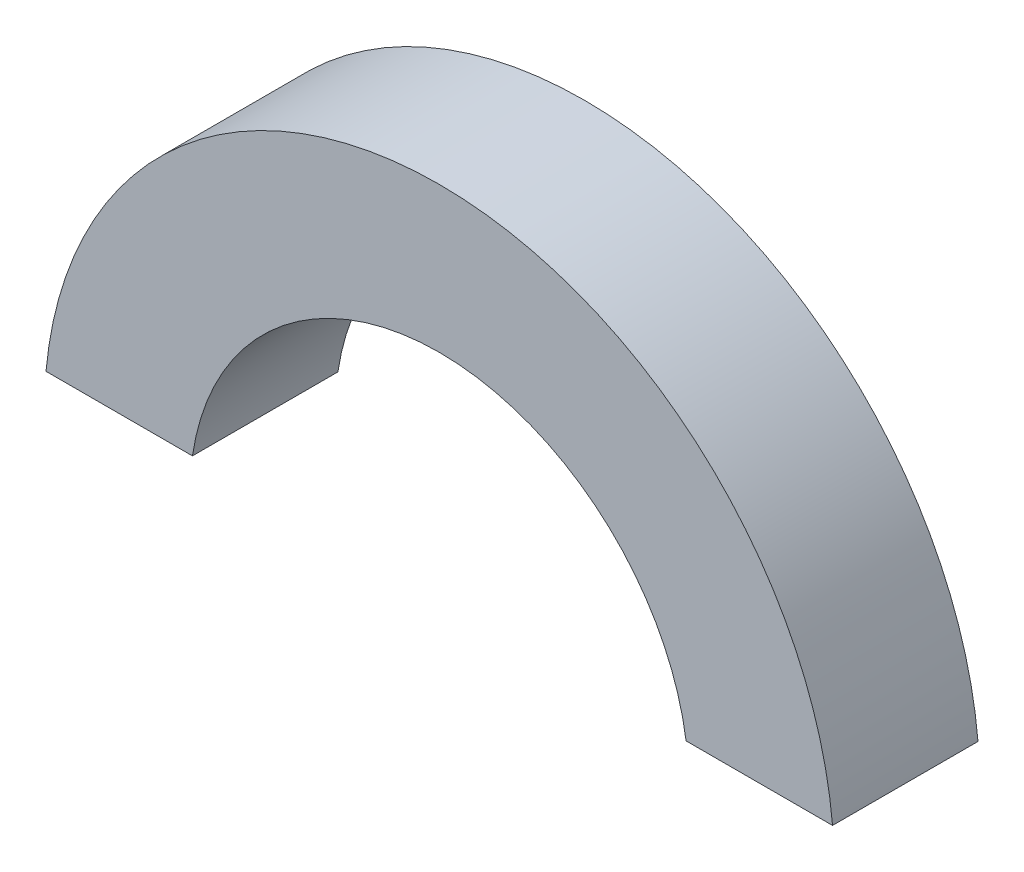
from build123d import *

# Parameters (mm, degrees)
BOSS_EXTRUDE1_DEPTH = 6.35


with BuildPart() as part:
    # Sketch1 → Boss-Extrude1 (new, symmetric)
    with BuildSketch(Plane.XY):
        with BuildLine():
            Line((-31.75, -2.427235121), (-31.75, -12.7))
            Line((-31.75, -12.7), (-21.547843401, -12.7))
            ThreePointArc((-21.547843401, -12.7), (0, 5.9055), (21.547843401, -12.7))
            Line((21.547843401, -12.7), (31.75, -12.7))
            Line((31.75, -12.7), (31.75, -2.427235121))
            ThreePointArc((31.75, -2.427235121), (26.620619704, 6.03954966), (19.297001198, 12.7))
            Line((19.297001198, 12.7), (-19.297001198, 12.7))
            ThreePointArc((-19.297001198, 12.7), (-26.620619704, 6.03954966), (-31.75, -2.427235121))
        make_face()
        with BuildLine():
            ThreePointArc((19.297001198, 12.7), (0, 18.6055), (-19.297001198, 12.7))
            Line((-19.297001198, 12.7), (19.297001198, 12.7))
        make_face()
        with BuildLine():
            Line((-34.334010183, -12.7), (-31.75, -12.7))
            Line((-31.75, -12.7), (-31.75, -2.427235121))
            ThreePointArc((-31.75, -2.427235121), (-33.438847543, -7.463795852), (-34.334010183, -12.7))
        make_face()
        with BuildLine():
            Line((31.75, -2.427235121), (31.75, -12.7))
            Line((31.75, -12.7), (34.334010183, -12.7))
            ThreePointArc((34.334010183, -12.7), (33.438847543, -7.463795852), (31.75, -2.427235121))
        make_face()
    extrude(amount=BOSS_EXTRUDE1_DEPTH, both=True)


solid = part.part
